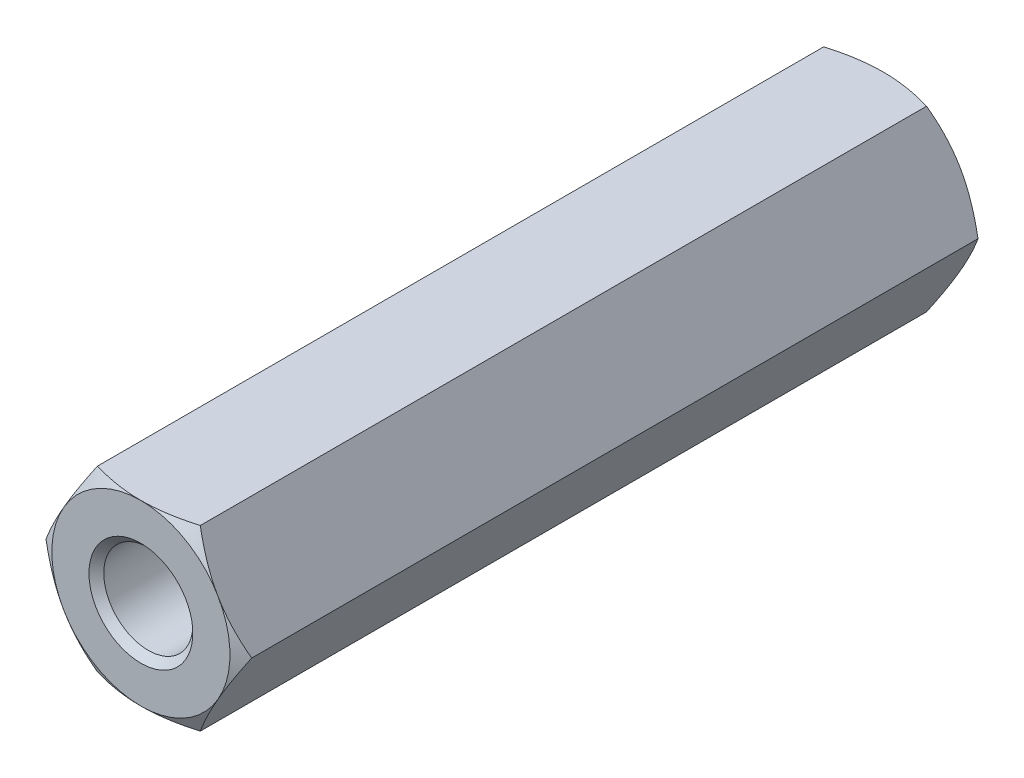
ISO-10303-21;
HEADER;
FILE_DESCRIPTION(('STEP AP214'),'2;1');
FILE_NAME('part.step','',(''),(''),'','','');
FILE_SCHEMA(('AUTOMOTIVE_DESIGN { 1 0 10303 214 1 1 1 1 }'));
ENDSEC;
DATA;
#1=APPLICATION_CONTEXT('core data for automotive mechanical design processes');
#2=APPLICATION_PROTOCOL_DEFINITION('international standard','automotive_design',2000,#1);
#3=PRODUCT_CONTEXT('',#1,'mechanical');
#4=PRODUCT('Part','Part','',(#3));
#5=PRODUCT_RELATED_PRODUCT_CATEGORY('part','',(#4));
#6=PRODUCT_DEFINITION_FORMATION('','',#4);
#7=PRODUCT_DEFINITION_CONTEXT('part definition',#1,'design');
#8=PRODUCT_DEFINITION('design','',#6,#7);
#9=PRODUCT_DEFINITION_SHAPE('','',#8);
#10=(LENGTH_UNIT() NAMED_UNIT(*) SI_UNIT(.MILLI.,.METRE.));
#11=(NAMED_UNIT(*) PLANE_ANGLE_UNIT() SI_UNIT($,.RADIAN.));
#12=(NAMED_UNIT(*) SI_UNIT($,.STERADIAN.) SOLID_ANGLE_UNIT());
#13=UNCERTAINTY_MEASURE_WITH_UNIT(LENGTH_MEASURE(1.E-05),#10,'distance_accuracy_value','');
#14=(GEOMETRIC_REPRESENTATION_CONTEXT(3) GLOBAL_UNCERTAINTY_ASSIGNED_CONTEXT((#13)) GLOBAL_UNIT_ASSIGNED_CONTEXT((#10,
#11,#12)) REPRESENTATION_CONTEXT('',''));
#15=CARTESIAN_POINT('',(0.,0.,0.));
#16=DIRECTION('',(0.,0.,1.));
#17=DIRECTION('',(1.,0.,0.));
#18=AXIS2_PLACEMENT_3D('',#15,#16,#17);
#19=CARTESIAN_POINT('',(3.46410161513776,0.,-12.5));
#20=DIRECTION('',(0.866025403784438,0.5,0.));
#21=DIRECTION('',(-0.5,0.866025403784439,0.));
#22=AXIS2_PLACEMENT_3D('',#19,#20,#21);
#23=PLANE('',#22);
#24=CARTESIAN_POINT('',(3.46421708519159,-0.000199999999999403,12.231984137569));
#25=CARTESIAN_POINT('',(3.38810199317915,0.131635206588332,12.2759462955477));
#26=CARTESIAN_POINT('',(3.31132988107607,0.26460840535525,12.3159284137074));
#27=CARTESIAN_POINT('',(3.15645624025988,0.532857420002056,12.3857179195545));
#28=CARTESIAN_POINT('',(3.078351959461,0.668138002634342,12.4155006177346));
#29=CARTESIAN_POINT('',(2.92311136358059,0.937022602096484,12.4618621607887));
#30=CARTESIAN_POINT('',(2.84599893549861,1.07058524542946,12.4787495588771));
#31=CARTESIAN_POINT('',(2.6914112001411,1.33833905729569,12.4989103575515));
#32=CARTESIAN_POINT('',(2.61393645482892,1.47252925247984,12.5022004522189));
#33=CARTESIAN_POINT('',(2.46916798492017,1.72327559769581,12.4953594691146));
#34=CARTESIAN_POINT('',(2.40185259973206,1.83986926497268,12.4869080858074));
#35=CARTESIAN_POINT('',(2.2676603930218,2.07229698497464,12.460121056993));
#36=CARTESIAN_POINT('',(2.2007840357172,2.18813023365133,12.4417762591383));
#37=CARTESIAN_POINT('',(2.06631510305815,2.42103725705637,12.3959152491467));
#38=CARTESIAN_POINT('',(1.99873954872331,2.53808155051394,12.3682046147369));
#39=CARTESIAN_POINT('',(1.86459637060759,2.77042435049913,12.3053122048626));
#40=CARTESIAN_POINT('',(1.79802702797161,2.88572583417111,12.2701452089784));
#41=CARTESIAN_POINT('',(1.73193533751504,3.0002,12.231984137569));
#42=B_SPLINE_CURVE_WITH_KNOTS('',3,(#24,#25,#26,#27,#28,#29,#30,#31,#32,#33,#34,#35,#36,#37,#38,
#39,#40,#41),.UNSPECIFIED.,.F.,.F.,(4,2,2,2,2,2,2,2,4),(0.,0.475539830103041,0.952222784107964,
1.41710776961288,1.88142182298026,2.28572436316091,2.69040156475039,3.10405572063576,
3.5168974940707),.UNSPECIFIED.);
#43=CARTESIAN_POINT('',(3.46410161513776,0.,12.2320508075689));
#44=VERTEX_POINT('',#43);
#45=CARTESIAN_POINT('',(2.59807621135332,1.5,12.5));
#46=VERTEX_POINT('',#45);
#47=EDGE_CURVE('E168',#44,#46,#42,.T.);
#48=ORIENTED_EDGE('',*,*,#47,.F.);
#49=DIRECTION('',(0.,0.,1.));
#50=VECTOR('',#49,1.);
#51=CARTESIAN_POINT('',(3.46410161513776,0.,-12.5));
#52=LINE('',#51,#50);
#53=CARTESIAN_POINT('',(3.46410161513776,0.,-12.2320508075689));
#54=VERTEX_POINT('',#53);
#55=EDGE_CURVE('E316',#54,#44,#52,.T.);
#56=ORIENTED_EDGE('',*,*,#55,.F.);
#57=CARTESIAN_POINT('',(3.46421708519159,-0.000199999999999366,-12.231984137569));
#58=CARTESIAN_POINT('',(3.38810199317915,0.131635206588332,-12.2759462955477));
#59=CARTESIAN_POINT('',(3.31132988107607,0.26460840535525,-12.3159284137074));
#60=CARTESIAN_POINT('',(3.15645624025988,0.532857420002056,-12.3857179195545));
#61=CARTESIAN_POINT('',(3.078351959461,0.668138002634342,-12.4155006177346));
#62=CARTESIAN_POINT('',(2.92311136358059,0.937022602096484,-12.4618621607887));
#63=CARTESIAN_POINT('',(2.84599893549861,1.07058524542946,-12.4787495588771));
#64=CARTESIAN_POINT('',(2.6914112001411,1.33833905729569,-12.4989103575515));
#65=CARTESIAN_POINT('',(2.61393645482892,1.47252925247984,-12.5022004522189));
#66=CARTESIAN_POINT('',(2.46916798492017,1.72327559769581,-12.4953594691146));
#67=CARTESIAN_POINT('',(2.40185259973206,1.83986926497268,-12.4869080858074));
#68=CARTESIAN_POINT('',(2.2676603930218,2.07229698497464,-12.460121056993));
#69=CARTESIAN_POINT('',(2.2007840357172,2.18813023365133,-12.4417762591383));
#70=CARTESIAN_POINT('',(2.06631510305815,2.42103725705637,-12.3959152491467));
#71=CARTESIAN_POINT('',(1.99873954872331,2.53808155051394,-12.3682046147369));
#72=CARTESIAN_POINT('',(1.86459637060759,2.77042435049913,-12.3053122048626));
#73=CARTESIAN_POINT('',(1.79802702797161,2.88572583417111,-12.2701452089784));
#74=CARTESIAN_POINT('',(1.73193533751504,3.0002,-12.231984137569));
#75=B_SPLINE_CURVE_WITH_KNOTS('',3,(#57,#58,#59,#60,#61,#62,#63,#64,#65,#66,#67,#68,#69,#70,#71,
#72,#73,#74),.UNSPECIFIED.,.F.,.F.,(4,2,2,2,2,2,2,2,4),(0.,0.475539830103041,0.952222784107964,
1.41710776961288,1.88142182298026,2.28572436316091,2.69040156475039,3.10405572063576,
3.5168974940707),.UNSPECIFIED.);
#76=CARTESIAN_POINT('',(2.59807621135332,1.5,-12.5));
#77=VERTEX_POINT('',#76);
#78=EDGE_CURVE('E302',#54,#77,#75,.T.);
#79=ORIENTED_EDGE('',*,*,#78,.T.);
#80=CARTESIAN_POINT('',(1.73205080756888,3.,-12.2320508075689));
#81=VERTEX_POINT('',#80);
#82=EDGE_CURVE('E249',#77,#81,#75,.T.);
#83=ORIENTED_EDGE('',*,*,#82,.T.);
#84=DIRECTION('',(0.,0.,1.));
#85=VECTOR('',#84,1.);
#86=CARTESIAN_POINT('',(1.73205080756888,3.,-12.5));
#87=LINE('',#86,#85);
#88=CARTESIAN_POINT('',(1.73205080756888,3.,12.2320508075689));
#89=VERTEX_POINT('',#88);
#90=EDGE_CURVE('E351',#81,#89,#87,.T.);
#91=ORIENTED_EDGE('',*,*,#90,.T.);
#92=EDGE_CURVE('E144',#46,#89,#42,.T.);
#93=ORIENTED_EDGE('',*,*,#92,.F.);
#94=EDGE_LOOP('',(#48,#56,#79,#83,#91,#93));
#95=FACE_BOUND('',#94,.T.);
#96=ADVANCED_FACE('F41',(#95),#23,.T.);
#97=CARTESIAN_POINT('',(1.73205080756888,-3.,-12.5));
#98=DIRECTION('',(0.866025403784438,-0.5,0.));
#99=DIRECTION('',(0.5,0.866025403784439,0.));
#100=AXIS2_PLACEMENT_3D('',#97,#98,#99);
#101=PLANE('',#100);
#102=CARTESIAN_POINT('',(1.73193533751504,-3.0002,12.231984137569));
#103=CARTESIAN_POINT('',(1.80805042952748,-2.86836479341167,12.2759462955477));
#104=CARTESIAN_POINT('',(1.88482254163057,-2.73539159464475,12.3159284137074));
#105=CARTESIAN_POINT('',(2.03969618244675,-2.46714257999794,12.3857179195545));
#106=CARTESIAN_POINT('',(2.11780046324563,-2.33186199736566,12.4155006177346));
#107=CARTESIAN_POINT('',(2.27304105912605,-2.06297739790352,12.4618621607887));
#108=CARTESIAN_POINT('',(2.35015348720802,-1.92941475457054,12.4787495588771));
#109=CARTESIAN_POINT('',(2.50474122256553,-1.66166094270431,12.4989103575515));
#110=CARTESIAN_POINT('',(2.58221596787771,-1.52747074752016,12.5022004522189));
#111=CARTESIAN_POINT('',(2.72698443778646,-1.27672440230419,12.4953594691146));
#112=CARTESIAN_POINT('',(2.79429982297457,-1.16013073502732,12.4869080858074));
#113=CARTESIAN_POINT('',(2.92849202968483,-0.927703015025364,12.460121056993));
#114=CARTESIAN_POINT('',(2.99536838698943,-0.81186976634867,12.4417762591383));
#115=CARTESIAN_POINT('',(3.12983731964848,-0.578962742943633,12.3959152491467));
#116=CARTESIAN_POINT('',(3.19741287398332,-0.46191844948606,12.3682046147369));
#117=CARTESIAN_POINT('',(3.33155605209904,-0.229575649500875,12.3053122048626));
#118=CARTESIAN_POINT('',(3.39812539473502,-0.114274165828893,12.2701452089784));
#119=CARTESIAN_POINT('',(3.46421708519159,0.000200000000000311,12.231984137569));
#120=B_SPLINE_CURVE_WITH_KNOTS('',3,(#102,#103,#104,#105,#106,#107,#108,#109,#110,#111,#112,
#113,#114,#115,#116,#117,#118,#119),.UNSPECIFIED.,.F.,.F.,(4,2,2,2,2,2,2,2,4),(0.,
0.47553983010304,0.952222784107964,1.41710776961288,1.88142182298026,2.28572436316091,
2.69040156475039,3.10405572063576,3.5168974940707),.UNSPECIFIED.);
#121=CARTESIAN_POINT('',(1.73205080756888,-3.,12.2320508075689));
#122=VERTEX_POINT('',#121);
#123=CARTESIAN_POINT('',(2.59807621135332,-1.5,12.5));
#124=VERTEX_POINT('',#123);
#125=EDGE_CURVE('E399',#122,#124,#120,.T.);
#126=ORIENTED_EDGE('',*,*,#125,.F.);
#127=DIRECTION('',(0.,0.,1.));
#128=VECTOR('',#127,1.);
#129=CARTESIAN_POINT('',(1.73205080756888,-3.,-12.5));
#130=LINE('',#129,#128);
#131=CARTESIAN_POINT('',(1.73205080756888,-3.,-12.2320508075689));
#132=VERTEX_POINT('',#131);
#133=EDGE_CURVE('E401',#132,#122,#130,.T.);
#134=ORIENTED_EDGE('',*,*,#133,.F.);
#135=CARTESIAN_POINT('',(1.73193533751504,-3.0002,-12.231984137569));
#136=CARTESIAN_POINT('',(1.80805042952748,-2.86836479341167,-12.2759462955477));
#137=CARTESIAN_POINT('',(1.88482254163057,-2.73539159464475,-12.3159284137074));
#138=CARTESIAN_POINT('',(2.03969618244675,-2.46714257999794,-12.3857179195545));
#139=CARTESIAN_POINT('',(2.11780046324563,-2.33186199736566,-12.4155006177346));
#140=CARTESIAN_POINT('',(2.27304105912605,-2.06297739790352,-12.4618621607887));
#141=CARTESIAN_POINT('',(2.35015348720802,-1.92941475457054,-12.4787495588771));
#142=CARTESIAN_POINT('',(2.50474122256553,-1.66166094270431,-12.4989103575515));
#143=CARTESIAN_POINT('',(2.58221596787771,-1.52747074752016,-12.5022004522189));
#144=CARTESIAN_POINT('',(2.72698443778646,-1.27672440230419,-12.4953594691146));
#145=CARTESIAN_POINT('',(2.79429982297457,-1.16013073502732,-12.4869080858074));
#146=CARTESIAN_POINT('',(2.92849202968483,-0.927703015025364,-12.460121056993));
#147=CARTESIAN_POINT('',(2.99536838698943,-0.81186976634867,-12.4417762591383));
#148=CARTESIAN_POINT('',(3.12983731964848,-0.578962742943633,-12.3959152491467));
#149=CARTESIAN_POINT('',(3.19741287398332,-0.46191844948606,-12.3682046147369));
#150=CARTESIAN_POINT('',(3.33155605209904,-0.229575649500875,-12.3053122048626));
#151=CARTESIAN_POINT('',(3.39812539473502,-0.114274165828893,-12.2701452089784));
#152=CARTESIAN_POINT('',(3.46421708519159,0.000200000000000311,-12.231984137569));
#153=B_SPLINE_CURVE_WITH_KNOTS('',3,(#135,#136,#137,#138,#139,#140,#141,#142,#143,#144,#145,
#146,#147,#148,#149,#150,#151,#152),.UNSPECIFIED.,.F.,.F.,(4,2,2,2,2,2,2,2,4),(0.,
0.47553983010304,0.952222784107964,1.41710776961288,1.88142182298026,2.28572436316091,
2.69040156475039,3.10405572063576,3.5168974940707),.UNSPECIFIED.);
#154=CARTESIAN_POINT('',(2.59807621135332,-1.5,-12.5));
#155=VERTEX_POINT('',#154);
#156=EDGE_CURVE('E331',#132,#155,#153,.T.);
#157=ORIENTED_EDGE('',*,*,#156,.T.);
#158=EDGE_CURVE('E246',#155,#54,#153,.T.);
#159=ORIENTED_EDGE('',*,*,#158,.T.);
#160=ORIENTED_EDGE('',*,*,#55,.T.);
#161=EDGE_CURVE('E172',#124,#44,#120,.T.);
#162=ORIENTED_EDGE('',*,*,#161,.F.);
#163=EDGE_LOOP('',(#126,#134,#157,#159,#160,#162));
#164=FACE_BOUND('',#163,.T.);
#165=ADVANCED_FACE('F328',(#164),#101,.T.);
#166=CARTESIAN_POINT('',(-1.73205080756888,-3.,-12.5));
#167=DIRECTION('',(0.,-1.,0.));
#168=DIRECTION('',(0.,0.,-1.));
#169=AXIS2_PLACEMENT_3D('',#166,#167,#168);
#170=PLANE('',#169);
#171=CARTESIAN_POINT('',(-20.0970818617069,-3.,2.5004311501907));
#172=CARTESIAN_POINT('',(-19.6678559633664,-3.,2.74552632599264));
#173=CARTESIAN_POINT('',(-19.2385588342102,-3.,2.99049684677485));
#174=CARTESIAN_POINT('',(-18.3797844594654,-3.,3.48012276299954));
#175=CARTESIAN_POINT('',(-17.9503072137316,-3.,3.72477815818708));
#176=CARTESIAN_POINT('',(-16.6615000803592,-3.,4.45820066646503));
#177=CARTESIAN_POINT('',(-15.8018445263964,-3.,4.9463956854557));
#178=CARTESIAN_POINT('',(-14.0817472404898,-3.,5.92008243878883));
#179=CARTESIAN_POINT('',(-13.2213063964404,-3.,6.40557573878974));
#180=CARTESIAN_POINT('',(-11.9289037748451,-3.,7.13067422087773));
#181=CARTESIAN_POINT('',(-11.4978210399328,-3.,7.37184549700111));
#182=CARTESIAN_POINT('',(-10.6348451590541,-3.,7.85273305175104));
#183=CARTESIAN_POINT('',(-10.2029520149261,-3.,8.09244933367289));
#184=CARTESIAN_POINT('',(-9.33589068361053,-3.,8.57099730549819));
#185=CARTESIAN_POINT('',(-8.90071685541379,-3.,8.80981878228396));
#186=CARTESIAN_POINT('',(-8.0286522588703,-3.,9.28439793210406));
#187=CARTESIAN_POINT('',(-7.59176136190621,-3.,9.52015536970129));
#188=CARTESIAN_POINT('',(-6.93424283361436,-3.,9.87022233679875));
#189=CARTESIAN_POINT('',(-6.71459635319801,-3.,9.98637341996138));
#190=CARTESIAN_POINT('',(-6.27446063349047,-3.,10.2170663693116));
#191=CARTESIAN_POINT('',(-6.05397140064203,-3.,10.3316082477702));
#192=CARTESIAN_POINT('',(-5.61193440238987,-3.,10.5585609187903));
#193=CARTESIAN_POINT('',(-5.39038678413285,-3.,10.670971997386));
#194=CARTESIAN_POINT('',(-4.94586490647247,-3.,10.8929339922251));
#195=CARTESIAN_POINT('',(-4.72289068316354,-3.,11.0024849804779));
#196=CARTESIAN_POINT('',(-4.27009130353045,-3.,11.2199898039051));
#197=CARTESIAN_POINT('',(-4.04022349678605,-3.,11.3278551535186));
#198=CARTESIAN_POINT('',(-3.57769508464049,-3.,11.5376548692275));
#199=CARTESIAN_POINT('',(-3.34503382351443,-3.,11.6395878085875));
#200=CARTESIAN_POINT('',(-2.99319443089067,-3.,11.7857848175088));
#201=CARTESIAN_POINT('',(-2.87541484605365,-3.,11.8334094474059));
#202=CARTESIAN_POINT('',(-2.63876748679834,-3.,11.9258646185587));
#203=CARTESIAN_POINT('',(-2.51989978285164,-3.,11.9706953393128));
#204=CARTESIAN_POINT('',(-2.28095891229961,-3.,12.0568819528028));
#205=CARTESIAN_POINT('',(-2.16088627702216,-3.,12.0982393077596));
#206=CARTESIAN_POINT('',(-1.91930296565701,-3.,12.1766720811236));
#207=CARTESIAN_POINT('',(-1.79779184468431,-3.,12.2137461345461));
#208=CARTESIAN_POINT('',(-1.51038029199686,-3.,12.2946591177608));
#209=CARTESIAN_POINT('',(-1.34384927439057,-3.,12.3363144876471));
#210=CARTESIAN_POINT('',(-1.00818057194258,-3.,12.4070325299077));
#211=CARTESIAN_POINT('',(-0.839044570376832,-3.,12.4361030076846));
#212=CARTESIAN_POINT('',(-0.500018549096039,-3.,12.4786753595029));
#213=CARTESIAN_POINT('',(-0.330143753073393,-3.,12.4922926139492));
#214=CARTESIAN_POINT('',(-0.0749937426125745,-3.,12.5001592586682));
#215=CARTESIAN_POINT('',(0.010122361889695,-3.,12.5006876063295));
#216=CARTESIAN_POINT('',(0.180276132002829,-3.,12.4975686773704));
#217=CARTESIAN_POINT('',(0.265313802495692,-3.,12.4939216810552));
#218=CARTESIAN_POINT('',(0.453986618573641,-3.,12.4812907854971));
#219=CARTESIAN_POINT('',(0.55755505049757,-3.,12.4713009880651));
#220=CARTESIAN_POINT('',(0.763982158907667,-3.,12.4456674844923));
#221=CARTESIAN_POINT('',(0.866840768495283,-3.,12.430023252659));
#222=CARTESIAN_POINT('',(1.17418887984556,-3.,12.3754676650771));
#223=CARTESIAN_POINT('',(1.37734769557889,-3.,12.3289413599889));
#224=CARTESIAN_POINT('',(1.68019071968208,-3.,12.2475357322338));
#225=CARTESIAN_POINT('',(1.78147142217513,-3.,12.218236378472));
#226=CARTESIAN_POINT('',(1.9830440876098,-3.,12.1563837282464));
#227=CARTESIAN_POINT('',(2.08333604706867,-3.,12.1238304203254));
#228=CARTESIAN_POINT('',(2.28295861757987,-3.,12.0560159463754));
#229=CARTESIAN_POINT('',(2.38228950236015,-3.,12.0207555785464));
#230=CARTESIAN_POINT('',(2.58010837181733,-3.,11.9479634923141));
#231=CARTESIAN_POINT('',(2.67859638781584,-3.,11.9104318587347));
#232=CARTESIAN_POINT('',(2.98740715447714,-3.,11.789335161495));
#233=CARTESIAN_POINT('',(3.19639232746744,-3.,11.7023608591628));
#234=CARTESIAN_POINT('',(3.61178143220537,-3.,11.5224268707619));
#235=CARTESIAN_POINT('',(3.81818485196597,-3.,11.4294660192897));
#236=CARTESIAN_POINT('',(4.22913845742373,-3.,11.2392520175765));
#237=CARTESIAN_POINT('',(4.43368752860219,-3.,11.141996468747));
#238=CARTESIAN_POINT('',(4.84129279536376,-3.,10.9444028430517));
#239=CARTESIAN_POINT('',(5.04434894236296,-3.,10.844064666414));
#240=CARTESIAN_POINT('',(5.44964138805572,-3.,10.6409292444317));
#241=CARTESIAN_POINT('',(5.65187579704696,-3.,10.5381282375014));
#242=CARTESIAN_POINT('',(6.05544450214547,-3.,10.3307698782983));
#243=CARTESIAN_POINT('',(6.25677878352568,-3.,10.2262124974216));
#244=CARTESIAN_POINT('',(6.85957856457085,-3.,9.91059584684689));
#245=CARTESIAN_POINT('',(7.25998648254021,-3.,9.6975183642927));
#246=CARTESIAN_POINT('',(8.05742559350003,-3.,9.26880964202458));
#247=CARTESIAN_POINT('',(8.45446385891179,-3.,9.05319149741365));
#248=CARTESIAN_POINT('',(9.24732729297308,-3.,8.61965733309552));
#249=CARTESIAN_POINT('',(9.64315235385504,-3.,8.40174111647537));
#250=CARTESIAN_POINT('',(10.4335383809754,-3.,7.96451618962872));
#251=CARTESIAN_POINT('',(10.8281001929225,-3.,7.74520900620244));
#252=CARTESIAN_POINT('',(11.616571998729,-3.,7.30542537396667));
#253=CARTESIAN_POINT('',(12.0104819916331,-3.,7.0849489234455));
#254=CARTESIAN_POINT('',(13.0465247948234,-3.,6.50355676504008));
#255=CARTESIAN_POINT('',(13.6882512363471,-3.,6.14191718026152));
#256=CARTESIAN_POINT('',(14.9710279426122,-3.,5.41701478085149));
#257=CARTESIAN_POINT('',(15.6120779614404,-3.,5.05375153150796));
#258=CARTESIAN_POINT('',(16.8941277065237,-3.,4.32585893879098));
#259=CARTESIAN_POINT('',(17.5351269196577,-3.,3.96122869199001));
#260=CARTESIAN_POINT('',(18.8164929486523,-3.,3.23129355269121));
#261=CARTESIAN_POINT('',(19.4568598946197,-3.,2.86598888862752));
#262=CARTESIAN_POINT('',(20.0970818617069,-3.,2.5004311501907));
#263=B_SPLINE_CURVE_WITH_KNOTS('',3,(#171,#172,#173,#174,#175,#176,#177,#178,#179,#180,#181,
#182,#183,#184,#185,#186,#187,#188,#189,#190,#191,#192,#193,#194,#195,#196,#197,#198,#199,#200,
#201,#202,#203,#204,#205,#206,#207,#208,#209,#210,#211,#212,#213,#214,#215,#216,#217,#218,#219,
#220,#221,#222,#223,#224,#225,#226,#227,#228,#229,#230,#231,#232,#233,#234,#235,#236,#237,#238,
#239,#240,#241,#242,#243,#244,#245,#246,#247,#248,#249,#250,#251,#252,#253,#254,#255,#256,#257,
#258,#259,#260,#261,#262),.UNSPECIFIED.,.F.,.F.,(4,2,2,2,2,2,2,2,2,2,2,2,2,2,2,2,2,2,2,2,2,2,2,
2,2,2,2,2,2,2,2,2,2,2,2,2,2,2,2,2,2,2,2,2,2,4),(0.,1.48282121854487,2.96564363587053,
5.93146029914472,8.8953279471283,10.3772043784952,11.8590774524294,13.3482679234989,
14.8375721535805,15.5829671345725,16.3283564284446,17.0736449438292,17.8189146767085,
18.5806181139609,19.3425039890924,19.7236081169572,20.1046877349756,20.485606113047,
20.866645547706,21.3812411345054,21.8955170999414,22.4059274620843,22.6611913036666,
22.9164380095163,23.228407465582,23.5404059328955,24.1647112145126,24.4809831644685,
24.7972562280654,25.1134363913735,25.4296047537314,26.1085298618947,26.7875875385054,
27.4670293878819,28.1464932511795,28.827070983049,29.5076598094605,30.8683482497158,
32.2237640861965,33.5792970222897,34.9335367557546,36.2877784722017,38.4976084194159,
40.7080704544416,42.9204253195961,45.1321333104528),.UNSPECIFIED.);
#264=CARTESIAN_POINT('',(-1.73205080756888,-3.,12.2320508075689));
#265=VERTEX_POINT('',#264);
#266=CARTESIAN_POINT('',(0.,-3.,12.5));
#267=VERTEX_POINT('',#266);
#268=EDGE_CURVE('E390',#265,#267,#263,.T.);
#269=ORIENTED_EDGE('',*,*,#268,.F.);
#270=DIRECTION('',(0.,0.,1.));
#271=VECTOR('',#270,1.);
#272=CARTESIAN_POINT('',(-1.73205080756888,-3.,-12.5));
#273=LINE('',#272,#271);
#274=CARTESIAN_POINT('',(-1.73205080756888,-3.,-12.2320508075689));
#275=VERTEX_POINT('',#274);
#276=EDGE_CURVE('E402',#275,#265,#273,.T.);
#277=ORIENTED_EDGE('',*,*,#276,.F.);
#278=CARTESIAN_POINT('',(-11.714888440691,-3.,-7.25020264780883));
#279=CARTESIAN_POINT('',(-11.4582949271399,-3.,-7.39370932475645));
#280=CARTESIAN_POINT('',(-11.2015829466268,-3.,-7.53700477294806));
#281=CARTESIAN_POINT('',(-10.687857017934,-3.,-7.82305698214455));
#282=CARTESIAN_POINT('',(-10.4308430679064,-3.,-7.96581373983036));
#283=CARTESIAN_POINT('',(-9.91637973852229,-3.,-8.25071021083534));
#284=CARTESIAN_POINT('',(-9.65893025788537,-3.,-8.39284974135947));
#285=CARTESIAN_POINT('',(-9.14357941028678,-3.,-8.67630606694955));
#286=CARTESIAN_POINT('',(-8.88567804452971,-3.,-8.81762286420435));
#287=CARTESIAN_POINT('',(-8.36956456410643,-3.,-9.09907152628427));
#288=CARTESIAN_POINT('',(-8.1113530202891,-3.,-9.23920443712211));
#289=CARTESIAN_POINT('',(-7.59420266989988,-3.,-9.51812154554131));
#290=CARTESIAN_POINT('',(-7.33526386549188,-3.,-9.65690574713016));
#291=CARTESIAN_POINT('',(-6.81647126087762,-3.,-9.93267039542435));
#292=CARTESIAN_POINT('',(-6.55661758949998,-3.,-10.0696510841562));
#293=CARTESIAN_POINT('',(-6.03564774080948,-3.,-10.3411872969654));
#294=CARTESIAN_POINT('',(-5.77453158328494,-3.,-10.475742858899));
#295=CARTESIAN_POINT('',(-5.25192021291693,-3.,-10.7407697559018));
#296=CARTESIAN_POINT('',(-4.99043387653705,-3.,-10.8712585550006));
#297=CARTESIAN_POINT('',(-4.4650239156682,-3.,-11.1274046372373));
#298=CARTESIAN_POINT('',(-4.2010998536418,-3.,-11.2530610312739));
#299=CARTESIAN_POINT('',(-3.8020253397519,-3.,-11.4362843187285));
#300=CARTESIAN_POINT('',(-3.66814727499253,-3.,-11.4966188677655));
#301=CARTESIAN_POINT('',(-3.39935412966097,-3.,-11.6149264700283));
#302=CARTESIAN_POINT('',(-3.2644390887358,-3.,-11.6728996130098));
#303=CARTESIAN_POINT('',(-2.99338541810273,-3.,-11.7858592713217));
#304=CARTESIAN_POINT('',(-2.85724700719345,-3.,-11.8408463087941));
#305=CARTESIAN_POINT('',(-2.58350071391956,-3.,-11.9470126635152));
#306=CARTESIAN_POINT('',(-2.4458929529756,-3.,-11.9981922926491));
#307=CARTESIAN_POINT('',(-2.13383798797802,-3.,-12.1080372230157));
#308=CARTESIAN_POINT('',(-1.95889295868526,-3.,-12.1653123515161));
#309=CARTESIAN_POINT('',(-1.60586883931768,-3.,-12.269416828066));
#310=CARTESIAN_POINT('',(-1.42778975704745,-3.,-12.3162462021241));
#311=CARTESIAN_POINT('',(-1.0704379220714,-3.,-12.3954723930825));
#312=CARTESIAN_POINT('',(-0.891201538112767,-3.,-12.4280266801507));
#313=CARTESIAN_POINT('',(-0.620686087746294,-3.,-12.4640461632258));
#314=CARTESIAN_POINT('',(-0.530242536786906,-3.,-12.4739171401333));
#315=CARTESIAN_POINT('',(-0.348977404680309,-3.,-12.4890880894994));
#316=CARTESIAN_POINT('',(-0.258155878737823,-3.,-12.4943887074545));
#317=CARTESIAN_POINT('',(-0.0753482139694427,-3.,-12.5002641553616));
#318=CARTESIAN_POINT('',(0.0166396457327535,-3.,-12.5007857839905));
#319=CARTESIAN_POINT('',(0.200512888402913,-3.,-12.4969462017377));
#320=CARTESIAN_POINT('',(0.29239827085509,-3.,-12.4925849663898));
#321=CARTESIAN_POINT('',(0.475838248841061,-3.,-12.4791350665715));
#322=CARTESIAN_POINT('',(0.567392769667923,-3.,-12.4700453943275));
#323=CARTESIAN_POINT('',(0.74995514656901,-3.,-12.4474425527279));
#324=CARTESIAN_POINT('',(0.840962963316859,-3.,-12.4339290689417));
#325=CARTESIAN_POINT('',(1.02332719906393,-3.,-12.4027043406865));
#326=CARTESIAN_POINT('',(1.1146755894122,-3.,-12.3849466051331));
#327=CARTESIAN_POINT('',(1.29658225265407,-3.,-12.3457845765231));
#328=CARTESIAN_POINT('',(1.38714051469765,-3.,-12.3243802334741));
#329=CARTESIAN_POINT('',(1.56745379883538,-3.,-12.2783905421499));
#330=CARTESIAN_POINT('',(1.65720870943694,-3.,-12.253804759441));
#331=CARTESIAN_POINT('',(1.83591195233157,-3.,-12.2018935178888));
#332=CARTESIAN_POINT('',(1.92486032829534,-3.,-12.1745682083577));
#333=CARTESIAN_POINT('',(2.18397067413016,-3.,-12.0912078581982));
#334=CARTESIAN_POINT('',(2.35311433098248,-3.,-12.0320055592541));
#335=CARTESIAN_POINT('',(2.68904747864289,-3.,-11.9072242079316));
#336=CARTESIAN_POINT('',(2.85583628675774,-3.,-11.8416433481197));
#337=CARTESIAN_POINT('',(3.18763299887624,-3.,-11.7057004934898));
#338=CARTESIAN_POINT('',(3.35263900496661,-3.,-11.635333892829));
#339=CARTESIAN_POINT('',(3.68107051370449,-3.,-11.491069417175));
#340=CARTESIAN_POINT('',(3.84449617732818,-3.,-11.4171719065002));
#341=CARTESIAN_POINT('',(4.17054259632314,-3.,-11.2664785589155));
#342=CARTESIAN_POINT('',(4.33315994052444,-3.,-11.189675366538));
#343=CARTESIAN_POINT('',(4.65738751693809,-3.,-11.0339683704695));
#344=CARTESIAN_POINT('',(4.81899772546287,-3.,-10.9550645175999));
#345=CARTESIAN_POINT('',(5.30243585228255,-3.,-10.7159937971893));
#346=CARTESIAN_POINT('',(5.62305344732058,-3.,-10.553382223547));
#347=CARTESIAN_POINT('',(6.26273083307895,-3.,-10.223676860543));
#348=CARTESIAN_POINT('',(6.58178651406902,-3.,-10.0565751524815));
#349=CARTESIAN_POINT('',(7.21842290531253,-3.,-9.71949292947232));
#350=CARTESIAN_POINT('',(7.53600342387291,-3.,-9.54951205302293));
#351=CARTESIAN_POINT('',(8.16962031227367,-3.,-9.20777723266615));
#352=CARTESIAN_POINT('',(8.48565824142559,-3.,-9.03602617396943));
#353=CARTESIAN_POINT('',(9.11692928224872,-3.,-8.69105090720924));
#354=CARTESIAN_POINT('',(9.43216239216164,-3.,-8.51782669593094));
#355=CARTESIAN_POINT('',(9.9115562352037,-3.,-8.25329328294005));
#356=CARTESIAN_POINT('',(10.0759399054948,-3.,-8.16238758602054));
#357=CARTESIAN_POINT('',(10.4045981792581,-3.,-7.98029040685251));
#358=CARTESIAN_POINT('',(10.56887274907,-3.,-7.88909886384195));
#359=CARTESIAN_POINT('',(10.8968543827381,-3.,-7.70672856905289));
#360=CARTESIAN_POINT('',(11.0605617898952,-3.,-7.61555043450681));
#361=CARTESIAN_POINT('',(11.3878254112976,-3.,-7.43301183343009));
#362=CARTESIAN_POINT('',(11.5513816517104,-3.,-7.34165141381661));
#363=CARTESIAN_POINT('',(11.714888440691,-3.,-7.25020264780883));
#364=B_SPLINE_CURVE_WITH_KNOTS('',3,(#278,#279,#280,#281,#282,#283,#284,#285,#286,#287,#288,
#289,#290,#291,#292,#293,#294,#295,#296,#297,#298,#299,#300,#301,#302,#303,#304,#305,#306,#307,
#308,#309,#310,#311,#312,#313,#314,#315,#316,#317,#318,#319,#320,#321,#322,#323,#324,#325,#326,
#327,#328,#329,#330,#331,#332,#333,#334,#335,#336,#337,#338,#339,#340,#341,#342,#343,#344,#345,
#346,#347,#348,#349,#350,#351,#352,#353,#354,#355,#356,#357,#358,#359,#360,#361,#362,#363),
.UNSPECIFIED.,.F.,.F.,(4,2,2,2,2,2,2,2,2,2,2,2,2,2,2,2,2,2,2,2,2,2,2,2,2,2,2,2,2,2,2,2,2,2,2,2,
2,2,2,2,2,2,4),(0.,0.881992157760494,1.76398974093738,2.64623280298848,3.52847351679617,
4.40982964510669,5.29118315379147,6.17241715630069,7.05363739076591,7.930319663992,
8.80716247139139,9.2476816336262,9.68818403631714,10.128609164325,10.5689981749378,
11.1209989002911,11.6729982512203,12.218745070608,12.4915881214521,12.7643926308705,
13.0402304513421,13.316069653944,13.5919676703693,13.8678853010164,14.1469762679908,
14.4260710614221,14.7052040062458,14.9843217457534,15.5217386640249,16.0593083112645,
16.5974028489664,17.1354419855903,17.6749486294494,18.2144679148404,19.292902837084,
20.3733838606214,21.45400156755,22.5330729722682,23.6121467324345,24.1756822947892,
24.7393471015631,25.3015053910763,25.8635339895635),.UNSPECIFIED.);
#365=CARTESIAN_POINT('',(0.,-3.,-12.5));
#366=VERTEX_POINT('',#365);
#367=EDGE_CURVE('E344',#275,#366,#364,.T.);
#368=ORIENTED_EDGE('',*,*,#367,.T.);
#369=EDGE_CURVE('E274',#366,#132,#364,.T.);
#370=ORIENTED_EDGE('',*,*,#369,.T.);
#371=ORIENTED_EDGE('',*,*,#133,.T.);
#372=EDGE_CURVE('E208',#267,#122,#263,.T.);
#373=ORIENTED_EDGE('',*,*,#372,.F.);
#374=EDGE_LOOP('',(#269,#277,#368,#370,#371,#373));
#375=FACE_BOUND('',#374,.T.);
#376=ADVANCED_FACE('F231',(#375),#170,.T.);
#377=CARTESIAN_POINT('',(-3.46410161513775,0.,-12.5));
#378=DIRECTION('',(-0.866025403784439,-0.5,0.));
#379=DIRECTION('',(0.5,-0.866025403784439,0.));
#380=AXIS2_PLACEMENT_3D('',#377,#378,#379);
#381=PLANE('',#380);
#382=CARTESIAN_POINT('',(-3.46421708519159,0.000200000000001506,12.231984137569));
#383=CARTESIAN_POINT('',(-3.38810199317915,-0.13163520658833,12.2759462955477));
#384=CARTESIAN_POINT('',(-3.31132988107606,-0.264608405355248,12.3159284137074));
#385=CARTESIAN_POINT('',(-3.15645624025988,-0.532857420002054,12.3857179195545));
#386=CARTESIAN_POINT('',(-3.078351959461,-0.66813800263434,12.4155006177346));
#387=CARTESIAN_POINT('',(-2.92311136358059,-0.937022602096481,12.4618621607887));
#388=CARTESIAN_POINT('',(-2.84599893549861,-1.07058524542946,12.4787495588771));
#389=CARTESIAN_POINT('',(-2.6914112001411,-1.33833905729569,12.4989103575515));
#390=CARTESIAN_POINT('',(-2.61393645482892,-1.47252925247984,12.5022004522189));
#391=CARTESIAN_POINT('',(-2.46916798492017,-1.72327559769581,12.4953594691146));
#392=CARTESIAN_POINT('',(-2.40185259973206,-1.83986926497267,12.4869080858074));
#393=CARTESIAN_POINT('',(-2.2676603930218,-2.07229698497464,12.460121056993));
#394=CARTESIAN_POINT('',(-2.2007840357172,-2.18813023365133,12.4417762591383));
#395=CARTESIAN_POINT('',(-2.06631510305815,-2.42103725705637,12.3959152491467));
#396=CARTESIAN_POINT('',(-1.99873954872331,-2.53808155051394,12.3682046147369));
#397=CARTESIAN_POINT('',(-1.86459637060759,-2.77042435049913,12.3053122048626));
#398=CARTESIAN_POINT('',(-1.79802702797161,-2.88572583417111,12.2701452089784));
#399=CARTESIAN_POINT('',(-1.73193533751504,-3.0002,12.231984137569));
#400=B_SPLINE_CURVE_WITH_KNOTS('',3,(#382,#383,#384,#385,#386,#387,#388,#389,#390,#391,#392,
#393,#394,#395,#396,#397,#398,#399),.UNSPECIFIED.,.F.,.F.,(4,2,2,2,2,2,2,2,4),(0.,
0.475539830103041,0.952222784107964,1.41710776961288,1.88142182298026,2.28572436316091,
2.69040156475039,3.10405572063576,3.5168974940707),.UNSPECIFIED.);
#401=CARTESIAN_POINT('',(-3.46410161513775,0.,12.2320508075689));
#402=VERTEX_POINT('',#401);
#403=CARTESIAN_POINT('',(-2.59807621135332,-1.5,12.5));
#404=VERTEX_POINT('',#403);
#405=EDGE_CURVE('E153',#402,#404,#400,.T.);
#406=ORIENTED_EDGE('',*,*,#405,.F.);
#407=DIRECTION('',(0.,0.,1.));
#408=VECTOR('',#407,1.);
#409=CARTESIAN_POINT('',(-3.46410161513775,0.,-12.5));
#410=LINE('',#409,#408);
#411=CARTESIAN_POINT('',(-3.46410161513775,0.,-12.2320508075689));
#412=VERTEX_POINT('',#411);
#413=EDGE_CURVE('E166',#412,#402,#410,.T.);
#414=ORIENTED_EDGE('',*,*,#413,.F.);
#415=CARTESIAN_POINT('',(-3.46421708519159,0.000200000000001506,-12.231984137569));
#416=CARTESIAN_POINT('',(-3.38810199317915,-0.13163520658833,-12.2759462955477));
#417=CARTESIAN_POINT('',(-3.31132988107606,-0.264608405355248,-12.3159284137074));
#418=CARTESIAN_POINT('',(-3.15645624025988,-0.532857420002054,-12.3857179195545));
#419=CARTESIAN_POINT('',(-3.078351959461,-0.66813800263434,-12.4155006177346));
#420=CARTESIAN_POINT('',(-2.92311136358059,-0.937022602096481,-12.4618621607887));
#421=CARTESIAN_POINT('',(-2.84599893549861,-1.07058524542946,-12.4787495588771));
#422=CARTESIAN_POINT('',(-2.6914112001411,-1.33833905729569,-12.4989103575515));
#423=CARTESIAN_POINT('',(-2.61393645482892,-1.47252925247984,-12.5022004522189));
#424=CARTESIAN_POINT('',(-2.46916798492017,-1.72327559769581,-12.4953594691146));
#425=CARTESIAN_POINT('',(-2.40185259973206,-1.83986926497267,-12.4869080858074));
#426=CARTESIAN_POINT('',(-2.2676603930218,-2.07229698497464,-12.460121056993));
#427=CARTESIAN_POINT('',(-2.2007840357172,-2.18813023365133,-12.4417762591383));
#428=CARTESIAN_POINT('',(-2.06631510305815,-2.42103725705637,-12.3959152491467));
#429=CARTESIAN_POINT('',(-1.99873954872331,-2.53808155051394,-12.3682046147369));
#430=CARTESIAN_POINT('',(-1.86459637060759,-2.77042435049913,-12.3053122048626));
#431=CARTESIAN_POINT('',(-1.79802702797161,-2.88572583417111,-12.2701452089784));
#432=CARTESIAN_POINT('',(-1.73193533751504,-3.0002,-12.231984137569));
#433=B_SPLINE_CURVE_WITH_KNOTS('',3,(#415,#416,#417,#418,#419,#420,#421,#422,#423,#424,#425,
#426,#427,#428,#429,#430,#431,#432),.UNSPECIFIED.,.F.,.F.,(4,2,2,2,2,2,2,2,4),(0.,
0.475539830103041,0.952222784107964,1.41710776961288,1.88142182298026,2.28572436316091,
2.69040156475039,3.10405572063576,3.5168974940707),.UNSPECIFIED.);
#434=CARTESIAN_POINT('',(-2.59807621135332,-1.5,-12.5));
#435=VERTEX_POINT('',#434);
#436=EDGE_CURVE('E236',#412,#435,#433,.T.);
#437=ORIENTED_EDGE('',*,*,#436,.T.);
#438=EDGE_CURVE('E248',#435,#275,#433,.T.);
#439=ORIENTED_EDGE('',*,*,#438,.T.);
#440=ORIENTED_EDGE('',*,*,#276,.T.);
#441=EDGE_CURVE('E174',#404,#265,#400,.T.);
#442=ORIENTED_EDGE('',*,*,#441,.F.);
#443=EDGE_LOOP('',(#406,#414,#437,#439,#440,#442));
#444=FACE_BOUND('',#443,.T.);
#445=ADVANCED_FACE('F228',(#444),#381,.T.);
#446=CARTESIAN_POINT('',(-1.73205080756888,3.,-12.5));
#447=DIRECTION('',(-0.866025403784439,0.5,0.));
#448=DIRECTION('',(-0.5,-0.866025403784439,0.));
#449=AXIS2_PLACEMENT_3D('',#446,#447,#448);
#450=PLANE('',#449);
#451=CARTESIAN_POINT('',(-1.73193533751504,3.0002,12.231984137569));
#452=CARTESIAN_POINT('',(-1.80805042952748,2.86836479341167,12.2759462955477));
#453=CARTESIAN_POINT('',(-1.88482254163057,2.73539159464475,12.3159284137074));
#454=CARTESIAN_POINT('',(-2.03969618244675,2.46714257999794,12.3857179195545));
#455=CARTESIAN_POINT('',(-2.11780046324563,2.33186199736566,12.4155006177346));
#456=CARTESIAN_POINT('',(-2.27304105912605,2.06297739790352,12.4618621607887));
#457=CARTESIAN_POINT('',(-2.35015348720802,1.92941475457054,12.4787495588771));
#458=CARTESIAN_POINT('',(-2.50474122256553,1.66166094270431,12.4989103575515));
#459=CARTESIAN_POINT('',(-2.58221596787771,1.52747074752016,12.5022004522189));
#460=CARTESIAN_POINT('',(-2.72698443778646,1.27672440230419,12.4953594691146));
#461=CARTESIAN_POINT('',(-2.79429982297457,1.16013073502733,12.4869080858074));
#462=CARTESIAN_POINT('',(-2.92849202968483,0.927703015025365,12.460121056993));
#463=CARTESIAN_POINT('',(-2.99536838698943,0.81186976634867,12.4417762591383));
#464=CARTESIAN_POINT('',(-3.12983731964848,0.578962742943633,12.3959152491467));
#465=CARTESIAN_POINT('',(-3.19741287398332,0.46191844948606,12.3682046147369));
#466=CARTESIAN_POINT('',(-3.33155605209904,0.229575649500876,12.3053122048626));
#467=CARTESIAN_POINT('',(-3.39812539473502,0.114274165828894,12.2701452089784));
#468=CARTESIAN_POINT('',(-3.46421708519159,-0.000199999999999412,12.231984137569));
#469=B_SPLINE_CURVE_WITH_KNOTS('',3,(#451,#452,#453,#454,#455,#456,#457,#458,#459,#460,#461,
#462,#463,#464,#465,#466,#467,#468),.UNSPECIFIED.,.F.,.F.,(4,2,2,2,2,2,2,2,4),(0.,
0.475539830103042,0.952222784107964,1.41710776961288,1.88142182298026,2.28572436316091,
2.69040156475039,3.10405572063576,3.5168974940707),.UNSPECIFIED.);
#470=CARTESIAN_POINT('',(-1.73205080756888,3.,12.2320508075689));
#471=VERTEX_POINT('',#470);
#472=CARTESIAN_POINT('',(-2.59807621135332,1.5,12.5));
#473=VERTEX_POINT('',#472);
#474=EDGE_CURVE('E132',#471,#473,#469,.T.);
#475=ORIENTED_EDGE('',*,*,#474,.F.);
#476=DIRECTION('',(0.,0.,1.));
#477=VECTOR('',#476,1.);
#478=CARTESIAN_POINT('',(-1.73205080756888,3.,-12.5));
#479=LINE('',#478,#477);
#480=CARTESIAN_POINT('',(-1.73205080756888,3.,-12.2320508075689));
#481=VERTEX_POINT('',#480);
#482=EDGE_CURVE('E354',#481,#471,#479,.T.);
#483=ORIENTED_EDGE('',*,*,#482,.F.);
#484=CARTESIAN_POINT('',(-1.73193533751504,3.0002,-12.231984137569));
#485=CARTESIAN_POINT('',(-1.80805042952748,2.86836479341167,-12.2759462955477));
#486=CARTESIAN_POINT('',(-1.88482254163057,2.73539159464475,-12.3159284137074));
#487=CARTESIAN_POINT('',(-2.03969618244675,2.46714257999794,-12.3857179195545));
#488=CARTESIAN_POINT('',(-2.11780046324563,2.33186199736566,-12.4155006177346));
#489=CARTESIAN_POINT('',(-2.27304105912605,2.06297739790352,-12.4618621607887));
#490=CARTESIAN_POINT('',(-2.35015348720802,1.92941475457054,-12.4787495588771));
#491=CARTESIAN_POINT('',(-2.50474122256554,1.66166094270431,-12.4989103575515));
#492=CARTESIAN_POINT('',(-2.58221596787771,1.52747074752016,-12.5022004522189));
#493=CARTESIAN_POINT('',(-2.72698443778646,1.27672440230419,-12.4953594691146));
#494=CARTESIAN_POINT('',(-2.79429982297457,1.16013073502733,-12.4869080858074));
#495=CARTESIAN_POINT('',(-2.92849202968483,0.927703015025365,-12.460121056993));
#496=CARTESIAN_POINT('',(-2.99536838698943,0.81186976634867,-12.4417762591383));
#497=CARTESIAN_POINT('',(-3.12983731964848,0.578962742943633,-12.3959152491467));
#498=CARTESIAN_POINT('',(-3.19741287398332,0.46191844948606,-12.3682046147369));
#499=CARTESIAN_POINT('',(-3.33155605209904,0.229575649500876,-12.3053122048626));
#500=CARTESIAN_POINT('',(-3.39812539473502,0.114274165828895,-12.2701452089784));
#501=CARTESIAN_POINT('',(-3.46421708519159,-0.000199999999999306,-12.231984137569));
#502=B_SPLINE_CURVE_WITH_KNOTS('',3,(#484,#485,#486,#487,#488,#489,#490,#491,#492,#493,#494,
#495,#496,#497,#498,#499,#500,#501),.UNSPECIFIED.,.F.,.F.,(4,2,2,2,2,2,2,2,4),(0.,
0.475539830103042,0.952222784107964,1.41710776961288,1.88142182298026,2.28572436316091,
2.69040156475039,3.10405572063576,3.5168974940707),.UNSPECIFIED.);
#503=CARTESIAN_POINT('',(-2.59807621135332,1.5,-12.5));
#504=VERTEX_POINT('',#503);
#505=EDGE_CURVE('E290',#481,#504,#502,.T.);
#506=ORIENTED_EDGE('',*,*,#505,.T.);
#507=EDGE_CURVE('E247',#504,#412,#502,.T.);
#508=ORIENTED_EDGE('',*,*,#507,.T.);
#509=ORIENTED_EDGE('',*,*,#413,.T.);
#510=EDGE_CURVE('E147',#473,#402,#469,.T.);
#511=ORIENTED_EDGE('',*,*,#510,.F.);
#512=EDGE_LOOP('',(#475,#483,#506,#508,#509,#511));
#513=FACE_BOUND('',#512,.T.);
#514=ADVANCED_FACE('F163',(#513),#450,.T.);
#515=CARTESIAN_POINT('',(1.73205080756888,3.,-12.5));
#516=DIRECTION('',(0.,1.,0.));
#517=DIRECTION('',(-1.,0.,0.));
#518=AXIS2_PLACEMENT_3D('',#515,#516,#517);
#519=PLANE('',#518);
#520=CARTESIAN_POINT('',(20.0970818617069,3.,2.5004311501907));
#521=CARTESIAN_POINT('',(19.6678559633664,3.,2.74552632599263));
#522=CARTESIAN_POINT('',(19.2385588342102,3.,2.99049684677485));
#523=CARTESIAN_POINT('',(18.3797844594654,3.,3.48012276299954));
#524=CARTESIAN_POINT('',(17.9503072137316,3.,3.72477815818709));
#525=CARTESIAN_POINT('',(16.6615000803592,3.,4.45820066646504));
#526=CARTESIAN_POINT('',(15.8018445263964,3.,4.9463956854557));
#527=CARTESIAN_POINT('',(14.0817472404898,3.,5.92008243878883));
#528=CARTESIAN_POINT('',(13.2213063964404,3.,6.40557573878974));
#529=CARTESIAN_POINT('',(11.9289037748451,3.,7.13067422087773));
#530=CARTESIAN_POINT('',(11.4978210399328,3.,7.37184549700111));
#531=CARTESIAN_POINT('',(10.6348451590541,3.,7.85273305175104));
#532=CARTESIAN_POINT('',(10.2029520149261,3.,8.09244933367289));
#533=CARTESIAN_POINT('',(9.33589068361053,3.,8.57099730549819));
#534=CARTESIAN_POINT('',(8.90071685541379,3.,8.80981878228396));
#535=CARTESIAN_POINT('',(8.0286522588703,3.,9.28439793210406));
#536=CARTESIAN_POINT('',(7.59176136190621,3.,9.52015536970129));
#537=CARTESIAN_POINT('',(6.93424283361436,3.,9.87022233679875));
#538=CARTESIAN_POINT('',(6.71459635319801,3.,9.98637341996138));
#539=CARTESIAN_POINT('',(6.27446063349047,3.,10.2170663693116));
#540=CARTESIAN_POINT('',(6.05397140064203,3.,10.3316082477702));
#541=CARTESIAN_POINT('',(5.61193440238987,3.,10.5585609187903));
#542=CARTESIAN_POINT('',(5.39038678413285,3.,10.670971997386));
#543=CARTESIAN_POINT('',(4.94586490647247,3.,10.8929339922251));
#544=CARTESIAN_POINT('',(4.72289068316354,3.,11.0024849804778));
#545=CARTESIAN_POINT('',(4.27009130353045,3.,11.2199898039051));
#546=CARTESIAN_POINT('',(4.04022349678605,3.,11.3278551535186));
#547=CARTESIAN_POINT('',(3.57769508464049,3.,11.5376548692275));
#548=CARTESIAN_POINT('',(3.34503382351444,3.,11.6395878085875));
#549=CARTESIAN_POINT('',(2.99319443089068,3.,11.7857848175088));
#550=CARTESIAN_POINT('',(2.87541484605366,3.,11.8334094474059));
#551=CARTESIAN_POINT('',(2.63876748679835,3.,11.9258646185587));
#552=CARTESIAN_POINT('',(2.51989978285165,3.,11.9706953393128));
#553=CARTESIAN_POINT('',(2.28095891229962,3.,12.0568819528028));
#554=CARTESIAN_POINT('',(2.16088627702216,3.,12.0982393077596));
#555=CARTESIAN_POINT('',(1.91930296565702,3.,12.1766720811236));
#556=CARTESIAN_POINT('',(1.79779184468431,3.,12.2137461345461));
#557=CARTESIAN_POINT('',(1.51038029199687,3.,12.2946591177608));
#558=CARTESIAN_POINT('',(1.34384927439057,3.,12.3363144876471));
#559=CARTESIAN_POINT('',(1.00818057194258,3.,12.4070325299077));
#560=CARTESIAN_POINT('',(0.839044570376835,3.,12.4361030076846));
#561=CARTESIAN_POINT('',(0.500018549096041,3.,12.4786753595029));
#562=CARTESIAN_POINT('',(0.330143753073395,3.,12.4922926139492));
#563=CARTESIAN_POINT('',(0.0749937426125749,3.,12.5001592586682));
#564=CARTESIAN_POINT('',(-0.0101223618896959,3.,12.5006876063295));
#565=CARTESIAN_POINT('',(-0.18027613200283,3.,12.4975686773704));
#566=CARTESIAN_POINT('',(-0.265313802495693,3.,12.4939216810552));
#567=CARTESIAN_POINT('',(-0.45398661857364,3.,12.4812907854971));
#568=CARTESIAN_POINT('',(-0.557555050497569,3.,12.4713009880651));
#569=CARTESIAN_POINT('',(-0.763982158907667,3.,12.4456674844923));
#570=CARTESIAN_POINT('',(-0.866840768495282,3.,12.430023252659));
#571=CARTESIAN_POINT('',(-1.17418887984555,3.,12.3754676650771));
#572=CARTESIAN_POINT('',(-1.37734769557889,3.,12.3289413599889));
#573=CARTESIAN_POINT('',(-1.68019071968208,3.,12.2475357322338));
#574=CARTESIAN_POINT('',(-1.78147142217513,3.,12.218236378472));
#575=CARTESIAN_POINT('',(-1.9830440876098,3.,12.1563837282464));
#576=CARTESIAN_POINT('',(-2.08333604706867,3.,12.1238304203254));
#577=CARTESIAN_POINT('',(-2.28295861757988,3.,12.0560159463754));
#578=CARTESIAN_POINT('',(-2.38228950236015,3.,12.0207555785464));
#579=CARTESIAN_POINT('',(-2.58010837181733,3.,11.9479634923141));
#580=CARTESIAN_POINT('',(-2.67859638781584,3.,11.9104318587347));
#581=CARTESIAN_POINT('',(-2.98740715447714,3.,11.789335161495));
#582=CARTESIAN_POINT('',(-3.19639232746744,3.,11.7023608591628));
#583=CARTESIAN_POINT('',(-3.61178143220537,3.,11.5224268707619));
#584=CARTESIAN_POINT('',(-3.81818485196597,3.,11.4294660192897));
#585=CARTESIAN_POINT('',(-4.22913845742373,3.,11.2392520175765));
#586=CARTESIAN_POINT('',(-4.43368752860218,3.,11.1419964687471));
#587=CARTESIAN_POINT('',(-4.84129279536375,3.,10.9444028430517));
#588=CARTESIAN_POINT('',(-5.04434894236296,3.,10.844064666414));
#589=CARTESIAN_POINT('',(-5.44964138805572,3.,10.6409292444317));
#590=CARTESIAN_POINT('',(-5.65187579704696,3.,10.5381282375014));
#591=CARTESIAN_POINT('',(-6.05544450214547,3.,10.3307698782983));
#592=CARTESIAN_POINT('',(-6.25677878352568,3.,10.2262124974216));
#593=CARTESIAN_POINT('',(-6.85957856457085,3.,9.91059584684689));
#594=CARTESIAN_POINT('',(-7.25998648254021,3.,9.6975183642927));
#595=CARTESIAN_POINT('',(-8.05742559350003,3.,9.26880964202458));
#596=CARTESIAN_POINT('',(-8.45446385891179,3.,9.05319149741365));
#597=CARTESIAN_POINT('',(-9.24732729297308,3.,8.61965733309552));
#598=CARTESIAN_POINT('',(-9.64315235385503,3.,8.40174111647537));
#599=CARTESIAN_POINT('',(-10.4335383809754,3.,7.96451618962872));
#600=CARTESIAN_POINT('',(-10.8281001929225,3.,7.74520900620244));
#601=CARTESIAN_POINT('',(-11.616571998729,3.,7.30542537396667));
#602=CARTESIAN_POINT('',(-12.0104819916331,3.,7.0849489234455));
#603=CARTESIAN_POINT('',(-13.0465247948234,3.,6.50355676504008));
#604=CARTESIAN_POINT('',(-13.6882512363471,3.,6.14191718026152));
#605=CARTESIAN_POINT('',(-14.9710279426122,3.,5.41701478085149));
#606=CARTESIAN_POINT('',(-15.6120779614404,3.,5.05375153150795));
#607=CARTESIAN_POINT('',(-16.8941277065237,3.,4.32585893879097));
#608=CARTESIAN_POINT('',(-17.5351269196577,3.,3.96122869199));
#609=CARTESIAN_POINT('',(-18.8164929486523,3.,3.2312935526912));
#610=CARTESIAN_POINT('',(-19.4568598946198,3.,2.8659888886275));
#611=CARTESIAN_POINT('',(-20.097081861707,3.,2.50043115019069));
#612=B_SPLINE_CURVE_WITH_KNOTS('',3,(#520,#521,#522,#523,#524,#525,#526,#527,#528,#529,#530,
#531,#532,#533,#534,#535,#536,#537,#538,#539,#540,#541,#542,#543,#544,#545,#546,#547,#548,#549,
#550,#551,#552,#553,#554,#555,#556,#557,#558,#559,#560,#561,#562,#563,#564,#565,#566,#567,#568,
#569,#570,#571,#572,#573,#574,#575,#576,#577,#578,#579,#580,#581,#582,#583,#584,#585,#586,#587,
#588,#589,#590,#591,#592,#593,#594,#595,#596,#597,#598,#599,#600,#601,#602,#603,#604,#605,#606,
#607,#608,#609,#610,#611),.UNSPECIFIED.,.F.,.F.,(4,2,2,2,2,2,2,2,2,2,2,2,2,2,2,2,2,2,2,2,2,2,2,
2,2,2,2,2,2,2,2,2,2,2,2,2,2,2,2,2,2,2,2,2,2,4),(0.,1.48282121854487,2.96564363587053,
5.93146029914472,8.8953279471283,10.3772043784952,11.8590774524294,13.3482679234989,
14.8375721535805,15.5829671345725,16.3283564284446,17.0736449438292,17.8189146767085,
18.5806181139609,19.3425039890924,19.7236081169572,20.1046877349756,20.485606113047,
20.866645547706,21.3812411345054,21.8955170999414,22.4059274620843,22.6611913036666,
22.9164380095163,23.228407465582,23.5404059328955,24.1647112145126,24.4809831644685,
24.7972562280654,25.1134363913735,25.4296047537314,26.1085298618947,26.7875875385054,
27.4670293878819,28.1464932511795,28.827070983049,29.5076598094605,30.8683482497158,
32.2237640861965,33.5792970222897,34.9335367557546,36.2877784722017,38.4976084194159,
40.7080704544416,42.9204253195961,45.1321333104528),.UNSPECIFIED.);
#613=CARTESIAN_POINT('',(0.,3.,12.5));
#614=VERTEX_POINT('',#613);
#615=EDGE_CURVE('E145',#89,#614,#612,.T.);
#616=ORIENTED_EDGE('',*,*,#615,.F.);
#617=ORIENTED_EDGE('',*,*,#90,.F.);
#618=CARTESIAN_POINT('',(11.714888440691,3.,-7.25020264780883));
#619=CARTESIAN_POINT('',(11.4582949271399,3.,-7.39370932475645));
#620=CARTESIAN_POINT('',(11.2015829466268,3.,-7.53700477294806));
#621=CARTESIAN_POINT('',(10.687857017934,3.,-7.82305698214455));
#622=CARTESIAN_POINT('',(10.4308430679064,3.,-7.96581373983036));
#623=CARTESIAN_POINT('',(9.9163797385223,3.,-8.25071021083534));
#624=CARTESIAN_POINT('',(9.65893025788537,3.,-8.39284974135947));
#625=CARTESIAN_POINT('',(9.14357941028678,3.,-8.67630606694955));
#626=CARTESIAN_POINT('',(8.88567804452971,3.,-8.81762286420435));
#627=CARTESIAN_POINT('',(8.36956456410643,3.,-9.09907152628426));
#628=CARTESIAN_POINT('',(8.1113530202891,3.,-9.23920443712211));
#629=CARTESIAN_POINT('',(7.59420266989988,3.,-9.51812154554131));
#630=CARTESIAN_POINT('',(7.33526386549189,3.,-9.65690574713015));
#631=CARTESIAN_POINT('',(6.81647126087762,3.,-9.93267039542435));
#632=CARTESIAN_POINT('',(6.55661758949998,3.,-10.0696510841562));
#633=CARTESIAN_POINT('',(6.03564774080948,3.,-10.3411872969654));
#634=CARTESIAN_POINT('',(5.77453158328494,3.,-10.475742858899));
#635=CARTESIAN_POINT('',(5.25192021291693,3.,-10.7407697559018));
#636=CARTESIAN_POINT('',(4.99043387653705,3.,-10.8712585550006));
#637=CARTESIAN_POINT('',(4.4650239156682,3.,-11.1274046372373));
#638=CARTESIAN_POINT('',(4.2010998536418,3.,-11.2530610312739));
#639=CARTESIAN_POINT('',(3.8020253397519,3.,-11.4362843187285));
#640=CARTESIAN_POINT('',(3.66814727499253,3.,-11.4966188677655));
#641=CARTESIAN_POINT('',(3.39935412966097,3.,-11.6149264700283));
#642=CARTESIAN_POINT('',(3.2644390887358,3.,-11.6728996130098));
#643=CARTESIAN_POINT('',(2.99338541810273,3.,-11.7858592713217));
#644=CARTESIAN_POINT('',(2.85724700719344,3.,-11.8408463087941));
#645=CARTESIAN_POINT('',(2.58350071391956,3.,-11.9470126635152));
#646=CARTESIAN_POINT('',(2.4458929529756,3.,-11.9981922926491));
#647=CARTESIAN_POINT('',(2.13383798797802,3.,-12.1080372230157));
#648=CARTESIAN_POINT('',(1.95889295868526,3.,-12.1653123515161));
#649=CARTESIAN_POINT('',(1.60586883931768,3.,-12.269416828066));
#650=CARTESIAN_POINT('',(1.42778975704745,3.,-12.3162462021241));
#651=CARTESIAN_POINT('',(1.0704379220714,3.,-12.3954723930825));
#652=CARTESIAN_POINT('',(0.891201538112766,3.,-12.4280266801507));
#653=CARTESIAN_POINT('',(0.620686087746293,3.,-12.4640461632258));
#654=CARTESIAN_POINT('',(0.530242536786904,3.,-12.4739171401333));
#655=CARTESIAN_POINT('',(0.348977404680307,3.,-12.4890880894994));
#656=CARTESIAN_POINT('',(0.258155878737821,3.,-12.4943887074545));
#657=CARTESIAN_POINT('',(0.07534821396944,3.,-12.5002641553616));
#658=CARTESIAN_POINT('',(-0.0166396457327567,3.,-12.5007857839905));
#659=CARTESIAN_POINT('',(-0.200512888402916,3.,-12.4969462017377));
#660=CARTESIAN_POINT('',(-0.292398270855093,3.,-12.4925849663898));
#661=CARTESIAN_POINT('',(-0.475838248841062,3.,-12.4791350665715));
#662=CARTESIAN_POINT('',(-0.567392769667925,3.,-12.4700453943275));
#663=CARTESIAN_POINT('',(-0.749955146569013,3.,-12.4474425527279));
#664=CARTESIAN_POINT('',(-0.840962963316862,3.,-12.4339290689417));
#665=CARTESIAN_POINT('',(-1.02332719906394,3.,-12.4027043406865));
#666=CARTESIAN_POINT('',(-1.1146755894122,3.,-12.3849466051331));
#667=CARTESIAN_POINT('',(-1.29658225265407,3.,-12.3457845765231));
#668=CARTESIAN_POINT('',(-1.38714051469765,3.,-12.3243802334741));
#669=CARTESIAN_POINT('',(-1.56745379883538,3.,-12.2783905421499));
#670=CARTESIAN_POINT('',(-1.65720870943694,3.,-12.253804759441));
#671=CARTESIAN_POINT('',(-1.83591195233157,3.,-12.2018935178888));
#672=CARTESIAN_POINT('',(-1.92486032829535,3.,-12.1745682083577));
#673=CARTESIAN_POINT('',(-2.18397067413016,3.,-12.0912078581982));
#674=CARTESIAN_POINT('',(-2.35311433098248,3.,-12.0320055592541));
#675=CARTESIAN_POINT('',(-2.68904747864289,3.,-11.9072242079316));
#676=CARTESIAN_POINT('',(-2.85583628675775,3.,-11.8416433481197));
#677=CARTESIAN_POINT('',(-3.18763299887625,3.,-11.7057004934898));
#678=CARTESIAN_POINT('',(-3.35263900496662,3.,-11.635333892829));
#679=CARTESIAN_POINT('',(-3.6810705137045,3.,-11.491069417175));
#680=CARTESIAN_POINT('',(-3.84449617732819,3.,-11.4171719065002));
#681=CARTESIAN_POINT('',(-4.17054259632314,3.,-11.2664785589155));
#682=CARTESIAN_POINT('',(-4.33315994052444,3.,-11.189675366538));
#683=CARTESIAN_POINT('',(-4.6573875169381,3.,-11.0339683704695));
#684=CARTESIAN_POINT('',(-4.81899772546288,3.,-10.9550645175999));
#685=CARTESIAN_POINT('',(-5.30243585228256,3.,-10.7159937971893));
#686=CARTESIAN_POINT('',(-5.62305344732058,3.,-10.553382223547));
#687=CARTESIAN_POINT('',(-6.26273083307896,3.,-10.223676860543));
#688=CARTESIAN_POINT('',(-6.58178651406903,3.,-10.0565751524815));
#689=CARTESIAN_POINT('',(-7.21842290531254,3.,-9.71949292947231));
#690=CARTESIAN_POINT('',(-7.53600342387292,3.,-9.54951205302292));
#691=CARTESIAN_POINT('',(-8.16962031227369,3.,-9.20777723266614));
#692=CARTESIAN_POINT('',(-8.48565824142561,3.,-9.03602617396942));
#693=CARTESIAN_POINT('',(-9.11692928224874,3.,-8.69105090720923));
#694=CARTESIAN_POINT('',(-9.43216239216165,3.,-8.51782669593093));
#695=CARTESIAN_POINT('',(-9.91155623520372,3.,-8.25329328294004));
#696=CARTESIAN_POINT('',(-10.0759399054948,3.,-8.16238758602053));
#697=CARTESIAN_POINT('',(-10.4045981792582,3.,-7.9802904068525));
#698=CARTESIAN_POINT('',(-10.56887274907,3.,-7.88909886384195));
#699=CARTESIAN_POINT('',(-10.8968543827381,3.,-7.70672856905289));
#700=CARTESIAN_POINT('',(-11.0605617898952,3.,-7.61555043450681));
#701=CARTESIAN_POINT('',(-11.3878254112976,3.,-7.43301183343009));
#702=CARTESIAN_POINT('',(-11.5513816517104,3.,-7.34165141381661));
#703=CARTESIAN_POINT('',(-11.714888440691,3.,-7.25020264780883));
#704=B_SPLINE_CURVE_WITH_KNOTS('',3,(#618,#619,#620,#621,#622,#623,#624,#625,#626,#627,#628,
#629,#630,#631,#632,#633,#634,#635,#636,#637,#638,#639,#640,#641,#642,#643,#644,#645,#646,#647,
#648,#649,#650,#651,#652,#653,#654,#655,#656,#657,#658,#659,#660,#661,#662,#663,#664,#665,#666,
#667,#668,#669,#670,#671,#672,#673,#674,#675,#676,#677,#678,#679,#680,#681,#682,#683,#684,#685,
#686,#687,#688,#689,#690,#691,#692,#693,#694,#695,#696,#697,#698,#699,#700,#701,#702,#703),
.UNSPECIFIED.,.F.,.F.,(4,2,2,2,2,2,2,2,2,2,2,2,2,2,2,2,2,2,2,2,2,2,2,2,2,2,2,2,2,2,2,2,2,2,2,2,
2,2,2,2,2,2,4),(0.,0.881992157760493,1.76398974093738,2.64623280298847,3.52847351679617,
4.40982964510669,5.29118315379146,6.17241715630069,7.05363739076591,7.930319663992,
8.80716247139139,9.24768163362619,9.68818403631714,10.128609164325,10.5689981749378,
11.1209989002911,11.6729982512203,12.218745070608,12.4915881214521,12.7643926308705,
13.0402304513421,13.316069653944,13.5919676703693,13.8678853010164,14.1469762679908,
14.4260710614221,14.7052040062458,14.9843217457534,15.5217386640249,16.0593083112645,
16.5974028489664,17.1354419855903,17.6749486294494,18.2144679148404,19.292902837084,
20.3733838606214,21.45400156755,22.5330729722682,23.6121467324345,24.1756822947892,
24.7393471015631,25.3015053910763,25.8635339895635),.UNSPECIFIED.);
#705=CARTESIAN_POINT('',(0.,3.,-12.5));
#706=VERTEX_POINT('',#705);
#707=EDGE_CURVE('E297',#81,#706,#704,.T.);
#708=ORIENTED_EDGE('',*,*,#707,.T.);
#709=EDGE_CURVE('E283',#706,#481,#704,.T.);
#710=ORIENTED_EDGE('',*,*,#709,.T.);
#711=ORIENTED_EDGE('',*,*,#482,.T.);
#712=EDGE_CURVE('E138',#614,#471,#612,.T.);
#713=ORIENTED_EDGE('',*,*,#712,.F.);
#714=EDGE_LOOP('',(#616,#617,#708,#710,#711,#713));
#715=FACE_BOUND('',#714,.T.);
#716=ADVANCED_FACE('F416',(#715),#519,.T.);
#717=CARTESIAN_POINT('',(0.,0.,-12.5));
#718=DIRECTION('',(0.,0.,1.));
#719=DIRECTION('',(-1.,0.,0.));
#720=AXIS2_PLACEMENT_3D('',#717,#718,#719);
#721=CONICAL_SURFACE('',#720,3.,1.0471975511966);
#722=CARTESIAN_POINT('',(0.,0.,-12.5));
#723=DIRECTION('',(0.,0.,1.));
#724=DIRECTION('',(1.,0.,0.));
#725=AXIS2_PLACEMENT_3D('',#722,#723,#724);
#726=CIRCLE('',#725,3.);
#727=EDGE_CURVE('E323',#155,#77,#726,.T.);
#728=ORIENTED_EDGE('',*,*,#727,.T.);
#729=ORIENTED_EDGE('',*,*,#78,.F.);
#730=ORIENTED_EDGE('',*,*,#158,.F.);
#731=EDGE_LOOP('',(#728,#729,#730));
#732=FACE_BOUND('',#731,.T.);
#733=ADVANCED_FACE('F321',(#732),#721,.T.);
#734=EDGE_CURVE('E363',#366,#155,#726,.T.);
#735=ORIENTED_EDGE('',*,*,#734,.T.);
#736=ORIENTED_EDGE('',*,*,#156,.F.);
#737=ORIENTED_EDGE('',*,*,#369,.F.);
#738=EDGE_LOOP('',(#735,#736,#737));
#739=FACE_BOUND('',#738,.T.);
#740=ADVANCED_FACE('F424',(#739),#721,.T.);
#741=ORIENTED_EDGE('',*,*,#438,.F.);
#742=EDGE_CURVE('E394',#435,#366,#726,.T.);
#743=ORIENTED_EDGE('',*,*,#742,.T.);
#744=ORIENTED_EDGE('',*,*,#367,.F.);
#745=EDGE_LOOP('',(#741,#743,#744));
#746=FACE_BOUND('',#745,.T.);
#747=ADVANCED_FACE('F268',(#746),#721,.T.);
#748=ORIENTED_EDGE('',*,*,#507,.F.);
#749=EDGE_CURVE('E395',#504,#435,#726,.T.);
#750=ORIENTED_EDGE('',*,*,#749,.T.);
#751=ORIENTED_EDGE('',*,*,#436,.F.);
#752=EDGE_LOOP('',(#748,#750,#751));
#753=FACE_BOUND('',#752,.T.);
#754=ADVANCED_FACE('F266',(#753),#721,.T.);
#755=ORIENTED_EDGE('',*,*,#709,.F.);
#756=CARTESIAN_POINT('',(0.,0.,-12.5));
#757=DIRECTION('',(0.,0.,-1.));
#758=DIRECTION('',(-1.,0.,0.));
#759=AXIS2_PLACEMENT_3D('',#756,#757,#758);
#760=CIRCLE('',#759,3.);
#761=EDGE_CURVE('E410',#504,#706,#760,.T.);
#762=ORIENTED_EDGE('',*,*,#761,.F.);
#763=ORIENTED_EDGE('',*,*,#505,.F.);
#764=EDGE_LOOP('',(#755,#762,#763));
#765=FACE_BOUND('',#764,.T.);
#766=ADVANCED_FACE('F260',(#765),#721,.T.);
#767=EDGE_CURVE('E364',#77,#706,#726,.T.);
#768=ORIENTED_EDGE('',*,*,#767,.T.);
#769=ORIENTED_EDGE('',*,*,#707,.F.);
#770=ORIENTED_EDGE('',*,*,#82,.F.);
#771=EDGE_LOOP('',(#768,#769,#770));
#772=FACE_BOUND('',#771,.T.);
#773=ADVANCED_FACE('F265',(#772),#721,.T.);
#774=CARTESIAN_POINT('',(0.,0.,-12.5));
#775=DIRECTION('',(0.,0.,1.));
#776=DIRECTION('',(1.,0.,0.));
#777=AXIS2_PLACEMENT_3D('',#774,#775,#776);
#778=PLANE('',#777);
#779=CARTESIAN_POINT('',(0.,0.,-12.5));
#780=DIRECTION('',(0.,0.,1.));
#781=DIRECTION('',(1.,0.,0.));
#782=AXIS2_PLACEMENT_3D('',#779,#780,#781);
#783=CIRCLE('',#782,1.75);
#784=CARTESIAN_POINT('',(1.75,0.,-12.5));
#785=VERTEX_POINT('',#784);
#786=EDGE_CURVE('E156',#785,#785,#783,.T.);
#787=ORIENTED_EDGE('',*,*,#786,.T.);
#788=EDGE_LOOP('',(#787));
#789=FACE_BOUND('',#788,.T.);
#790=ORIENTED_EDGE('',*,*,#767,.F.);
#791=ORIENTED_EDGE('',*,*,#727,.F.);
#792=ORIENTED_EDGE('',*,*,#734,.F.);
#793=ORIENTED_EDGE('',*,*,#742,.F.);
#794=ORIENTED_EDGE('',*,*,#749,.F.);
#795=ORIENTED_EDGE('',*,*,#761,.T.);
#796=EDGE_LOOP('',(#790,#791,#792,#793,#794,#795));
#797=FACE_BOUND('',#796,.T.);
#798=ADVANCED_FACE('F271',(#789,#797),#778,.F.);
#799=CARTESIAN_POINT('',(0.,0.,-5.5));
#800=DIRECTION('',(0.,0.,-1.));
#801=DIRECTION('',(-1.,0.,0.));
#802=AXIS2_PLACEMENT_3D('',#799,#800,#801);
#803=CYLINDRICAL_SURFACE('',#802,1.5);
#804=CARTESIAN_POINT('',(0.,0.,-12.25));
#805=DIRECTION('',(0.,0.,1.));
#806=DIRECTION('',(1.,0.,0.));
#807=AXIS2_PLACEMENT_3D('',#804,#805,#806);
#808=CIRCLE('',#807,1.5);
#809=CARTESIAN_POINT('',(1.5,0.,-12.25));
#810=VERTEX_POINT('',#809);
#811=EDGE_CURVE('E365',#810,#810,#808,.F.);
#812=ORIENTED_EDGE('',*,*,#811,.T.);
#813=EDGE_LOOP('',(#812));
#814=FACE_BOUND('',#813,.T.);
#815=CARTESIAN_POINT('',(0.,0.,-5.5));
#816=DIRECTION('',(0.,0.,-1.));
#817=DIRECTION('',(-1.,0.,0.));
#818=AXIS2_PLACEMENT_3D('',#815,#816,#817);
#819=CIRCLE('',#818,1.5);
#820=CARTESIAN_POINT('',(-1.5,0.,-5.5));
#821=VERTEX_POINT('',#820);
#822=EDGE_CURVE('E412',#821,#821,#819,.T.);
#823=ORIENTED_EDGE('',*,*,#822,.F.);
#824=EDGE_LOOP('',(#823));
#825=FACE_BOUND('',#824,.T.);
#826=ADVANCED_FACE('F269',(#814,#825),#803,.F.);
#827=CARTESIAN_POINT('',(0.,0.,-5.5));
#828=DIRECTION('',(0.,0.,-1.));
#829=DIRECTION('',(-1.,0.,0.));
#830=AXIS2_PLACEMENT_3D('',#827,#828,#829);
#831=PLANE('',#830);
#832=CARTESIAN_POINT('',(0.,0.,-5.5));
#833=DIRECTION('',(0.,0.,-1.));
#834=DIRECTION('',(-1.,0.,0.));
#835=AXIS2_PLACEMENT_3D('',#832,#833,#834);
#836=CIRCLE('',#835,1.25);
#837=CARTESIAN_POINT('',(-1.25,0.,-5.5));
#838=VERTEX_POINT('',#837);
#839=EDGE_CURVE('E459',#838,#838,#836,.T.);
#840=ORIENTED_EDGE('',*,*,#839,.F.);
#841=EDGE_LOOP('',(#840));
#842=FACE_BOUND('',#841,.T.);
#843=ORIENTED_EDGE('',*,*,#822,.T.);
#844=EDGE_LOOP('',(#843));
#845=FACE_BOUND('',#844,.T.);
#846=ADVANCED_FACE('F454',(#842,#845),#831,.T.);
#847=CARTESIAN_POINT('',(0.,0.,-1.75));
#848=DIRECTION('',(0.,0.,-1.));
#849=DIRECTION('',(-1.,0.,0.));
#850=AXIS2_PLACEMENT_3D('',#847,#848,#849);
#851=CYLINDRICAL_SURFACE('',#850,1.25);
#852=ORIENTED_EDGE('',*,*,#839,.T.);
#853=EDGE_LOOP('',(#852));
#854=FACE_BOUND('',#853,.T.);
#855=CARTESIAN_POINT('',(0.,0.,-1.75));
#856=DIRECTION('',(0.,0.,-1.));
#857=DIRECTION('',(-1.,0.,0.));
#858=AXIS2_PLACEMENT_3D('',#855,#856,#857);
#859=CIRCLE('',#858,1.25);
#860=CARTESIAN_POINT('',(-1.25,0.,-1.75));
#861=VERTEX_POINT('',#860);
#862=EDGE_CURVE('E392',#861,#861,#859,.T.);
#863=ORIENTED_EDGE('',*,*,#862,.F.);
#864=EDGE_LOOP('',(#863));
#865=FACE_BOUND('',#864,.T.);
#866=ADVANCED_FACE('F446',(#854,#865),#851,.F.);
#867=CARTESIAN_POINT('',(0.,0.,-1.75));
#868=DIRECTION('',(0.,0.,-1.));
#869=DIRECTION('',(-1.,0.,0.));
#870=AXIS2_PLACEMENT_3D('',#867,#868,#869);
#871=PLANE('',#870);
#872=ORIENTED_EDGE('',*,*,#862,.T.);
#873=EDGE_LOOP('',(#872));
#874=FACE_BOUND('',#873,.T.);
#875=ADVANCED_FACE('F439',(#874),#871,.T.);
#876=CARTESIAN_POINT('',(0.,0.,-12.25));
#877=DIRECTION('',(0.,0.,-1.));
#878=DIRECTION('',(-1.,0.,0.));
#879=AXIS2_PLACEMENT_3D('',#876,#877,#878);
#880=CONICAL_SURFACE('',#879,1.5,0.785398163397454);
#881=ORIENTED_EDGE('',*,*,#786,.F.);
#882=EDGE_LOOP('',(#881));
#883=FACE_BOUND('',#882,.T.);
#884=ORIENTED_EDGE('',*,*,#811,.F.);
#885=EDGE_LOOP('',(#884));
#886=FACE_BOUND('',#885,.T.);
#887=ADVANCED_FACE('F436',(#883,#886),#880,.F.);
#888=CARTESIAN_POINT('',(0.,0.,12.5));
#889=DIRECTION('',(0.,0.,-1.));
#890=DIRECTION('',(-1.,0.,0.));
#891=AXIS2_PLACEMENT_3D('',#888,#889,#890);
#892=CONICAL_SURFACE('',#891,3.,1.0471975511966);
#893=ORIENTED_EDGE('',*,*,#405,.T.);
#894=CARTESIAN_POINT('',(0.,0.,12.5));
#895=DIRECTION('',(0.,0.,-1.));
#896=DIRECTION('',(-1.,0.,0.));
#897=AXIS2_PLACEMENT_3D('',#894,#895,#896);
#898=CIRCLE('',#897,3.);
#899=EDGE_CURVE('E150',#473,#404,#898,.F.);
#900=ORIENTED_EDGE('',*,*,#899,.F.);
#901=ORIENTED_EDGE('',*,*,#510,.T.);
#902=EDGE_LOOP('',(#893,#900,#901));
#903=FACE_BOUND('',#902,.T.);
#904=ADVANCED_FACE('F151',(#903),#892,.T.);
#905=ORIENTED_EDGE('',*,*,#474,.T.);
#906=CARTESIAN_POINT('',(0.,0.,12.5));
#907=DIRECTION('',(0.,0.,-1.));
#908=DIRECTION('',(-1.,0.,0.));
#909=AXIS2_PLACEMENT_3D('',#906,#907,#908);
#910=CIRCLE('',#909,3.);
#911=EDGE_CURVE('E135',#473,#614,#910,.T.);
#912=ORIENTED_EDGE('',*,*,#911,.T.);
#913=ORIENTED_EDGE('',*,*,#712,.T.);
#914=EDGE_LOOP('',(#905,#912,#913));
#915=FACE_BOUND('',#914,.T.);
#916=ADVANCED_FACE('F134',(#915),#892,.T.);
#917=ORIENTED_EDGE('',*,*,#92,.T.);
#918=ORIENTED_EDGE('',*,*,#615,.T.);
#919=EDGE_CURVE('E65',#46,#614,#898,.F.);
#920=ORIENTED_EDGE('',*,*,#919,.F.);
#921=EDGE_LOOP('',(#917,#918,#920));
#922=FACE_BOUND('',#921,.T.);
#923=ADVANCED_FACE('F200',(#922),#892,.T.);
#924=ORIENTED_EDGE('',*,*,#161,.T.);
#925=ORIENTED_EDGE('',*,*,#47,.T.);
#926=EDGE_CURVE('E379',#124,#46,#898,.F.);
#927=ORIENTED_EDGE('',*,*,#926,.F.);
#928=EDGE_LOOP('',(#924,#925,#927));
#929=FACE_BOUND('',#928,.T.);
#930=ADVANCED_FACE('F445',(#929),#892,.T.);
#931=ORIENTED_EDGE('',*,*,#372,.T.);
#932=ORIENTED_EDGE('',*,*,#125,.T.);
#933=EDGE_CURVE('E374',#267,#124,#898,.F.);
#934=ORIENTED_EDGE('',*,*,#933,.F.);
#935=EDGE_LOOP('',(#931,#932,#934));
#936=FACE_BOUND('',#935,.T.);
#937=ADVANCED_FACE('F652',(#936),#892,.T.);
#938=ORIENTED_EDGE('',*,*,#268,.T.);
#939=EDGE_CURVE('E57',#404,#267,#898,.F.);
#940=ORIENTED_EDGE('',*,*,#939,.F.);
#941=ORIENTED_EDGE('',*,*,#441,.T.);
#942=EDGE_LOOP('',(#938,#940,#941));
#943=FACE_BOUND('',#942,.T.);
#944=ADVANCED_FACE('F201',(#943),#892,.T.);
#945=CARTESIAN_POINT('',(0.,0.,12.5));
#946=DIRECTION('',(0.,0.,-1.));
#947=DIRECTION('',(1.,0.,0.));
#948=AXIS2_PLACEMENT_3D('',#945,#946,#947);
#949=PLANE('',#948);
#950=CARTESIAN_POINT('',(0.,0.,12.5));
#951=DIRECTION('',(0.,0.,-1.));
#952=DIRECTION('',(-1.,0.,0.));
#953=AXIS2_PLACEMENT_3D('',#950,#951,#952);
#954=CIRCLE('',#953,1.75);
#955=CARTESIAN_POINT('',(-1.75,0.,12.5));
#956=VERTEX_POINT('',#955);
#957=EDGE_CURVE('E50',#956,#956,#954,.T.);
#958=ORIENTED_EDGE('',*,*,#957,.T.);
#959=EDGE_LOOP('',(#958));
#960=FACE_BOUND('',#959,.T.);
#961=ORIENTED_EDGE('',*,*,#899,.T.);
#962=ORIENTED_EDGE('',*,*,#939,.T.);
#963=ORIENTED_EDGE('',*,*,#933,.T.);
#964=ORIENTED_EDGE('',*,*,#926,.T.);
#965=ORIENTED_EDGE('',*,*,#919,.T.);
#966=ORIENTED_EDGE('',*,*,#911,.F.);
#967=EDGE_LOOP('',(#961,#962,#963,#964,#965,#966));
#968=FACE_BOUND('',#967,.T.);
#969=ADVANCED_FACE('F158',(#960,#968),#949,.F.);
#970=CARTESIAN_POINT('',(0.,0.,5.5));
#971=DIRECTION('',(0.,0.,1.));
#972=DIRECTION('',(-1.,0.,0.));
#973=AXIS2_PLACEMENT_3D('',#970,#971,#972);
#974=PLANE('',#973);
#975=CARTESIAN_POINT('',(0.,0.,5.5));
#976=DIRECTION('',(0.,0.,-1.));
#977=DIRECTION('',(-1.,0.,0.));
#978=AXIS2_PLACEMENT_3D('',#975,#976,#977);
#979=CIRCLE('',#978,1.5);
#980=CARTESIAN_POINT('',(-1.5,0.,5.5));
#981=VERTEX_POINT('',#980);
#982=EDGE_CURVE('E160',#981,#981,#979,.T.);
#983=ORIENTED_EDGE('',*,*,#982,.F.);
#984=EDGE_LOOP('',(#983));
#985=FACE_BOUND('',#984,.T.);
#986=CARTESIAN_POINT('',(0.,0.,5.5));
#987=DIRECTION('',(0.,0.,1.));
#988=DIRECTION('',(1.,0.,0.));
#989=AXIS2_PLACEMENT_3D('',#986,#987,#988);
#990=CIRCLE('',#989,1.25);
#991=CARTESIAN_POINT('',(1.25,0.,5.5));
#992=VERTEX_POINT('',#991);
#993=EDGE_CURVE('E385',#992,#992,#990,.F.);
#994=ORIENTED_EDGE('',*,*,#993,.T.);
#995=EDGE_LOOP('',(#994));
#996=FACE_BOUND('',#995,.T.);
#997=ADVANCED_FACE('F625',(#985,#996),#974,.T.);
#998=CARTESIAN_POINT('',(0.,0.,5.5));
#999=DIRECTION('',(0.,0.,1.));
#1000=DIRECTION('',(1.,0.,0.));
#1001=AXIS2_PLACEMENT_3D('',#998,#999,#1000);
#1002=CYLINDRICAL_SURFACE('',#1001,1.5);
#1003=CARTESIAN_POINT('',(0.,0.,12.25));
#1004=DIRECTION('',(0.,0.,-1.));
#1005=DIRECTION('',(-1.,0.,0.));
#1006=AXIS2_PLACEMENT_3D('',#1003,#1004,#1005);
#1007=CIRCLE('',#1006,1.5);
#1008=CARTESIAN_POINT('',(-1.5,0.,12.25));
#1009=VERTEX_POINT('',#1008);
#1010=EDGE_CURVE('E12',#1009,#1009,#1007,.F.);
#1011=ORIENTED_EDGE('',*,*,#1010,.T.);
#1012=EDGE_LOOP('',(#1011));
#1013=FACE_BOUND('',#1012,.T.);
#1014=ORIENTED_EDGE('',*,*,#982,.T.);
#1015=EDGE_LOOP('',(#1014));
#1016=FACE_BOUND('',#1015,.T.);
#1017=ADVANCED_FACE('F202',(#1013,#1016),#1002,.F.);
#1018=CARTESIAN_POINT('',(0.,0.,1.75));
#1019=DIRECTION('',(0.,0.,1.));
#1020=DIRECTION('',(1.,0.,0.));
#1021=AXIS2_PLACEMENT_3D('',#1018,#1019,#1020);
#1022=CYLINDRICAL_SURFACE('',#1021,1.25);
#1023=ORIENTED_EDGE('',*,*,#993,.F.);
#1024=EDGE_LOOP('',(#1023));
#1025=FACE_BOUND('',#1024,.T.);
#1026=CARTESIAN_POINT('',(0.,0.,1.75));
#1027=DIRECTION('',(0.,0.,-1.));
#1028=DIRECTION('',(-1.,0.,0.));
#1029=AXIS2_PLACEMENT_3D('',#1026,#1027,#1028);
#1030=CIRCLE('',#1029,1.25);
#1031=CARTESIAN_POINT('',(-1.25,0.,1.75));
#1032=VERTEX_POINT('',#1031);
#1033=EDGE_CURVE('E388',#1032,#1032,#1030,.T.);
#1034=ORIENTED_EDGE('',*,*,#1033,.T.);
#1035=EDGE_LOOP('',(#1034));
#1036=FACE_BOUND('',#1035,.T.);
#1037=ADVANCED_FACE('F682',(#1025,#1036),#1022,.F.);
#1038=CARTESIAN_POINT('',(0.,0.,1.75));
#1039=DIRECTION('',(0.,0.,1.));
#1040=DIRECTION('',(-1.,0.,0.));
#1041=AXIS2_PLACEMENT_3D('',#1038,#1039,#1040);
#1042=PLANE('',#1041);
#1043=ORIENTED_EDGE('',*,*,#1033,.F.);
#1044=EDGE_LOOP('',(#1043));
#1045=FACE_BOUND('',#1044,.T.);
#1046=ADVANCED_FACE('F691',(#1045),#1042,.T.);
#1047=CARTESIAN_POINT('',(0.,0.,12.5));
#1048=DIRECTION('',(0.,0.,1.));
#1049=DIRECTION('',(1.,0.,0.));
#1050=AXIS2_PLACEMENT_3D('',#1047,#1048,#1049);
#1051=CONICAL_SURFACE('',#1050,1.75,0.785398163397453);
#1052=ORIENTED_EDGE('',*,*,#1010,.F.);
#1053=EDGE_LOOP('',(#1052));
#1054=FACE_BOUND('',#1053,.T.);
#1055=ORIENTED_EDGE('',*,*,#957,.F.);
#1056=EDGE_LOOP('',(#1055));
#1057=FACE_BOUND('',#1056,.T.);
#1058=ADVANCED_FACE('F43',(#1054,#1057),#1051,.F.);
#1059=CLOSED_SHELL('',(#96,#165,#376,#445,#514,#716,#733,#740,#747,#754,#766,#773,#798,#826,
#846,#866,#875,#887,#904,#916,#923,#930,#937,#944,#969,#997,#1017,#1037,#1046,#1058));
#1060=MANIFOLD_SOLID_BREP('B2',#1059);
#1061=ADVANCED_BREP_SHAPE_REPRESENTATION('',(#18,#1060),#14);
#1062=SHAPE_DEFINITION_REPRESENTATION(#9,#1061);
ENDSEC;
END-ISO-10303-21;
